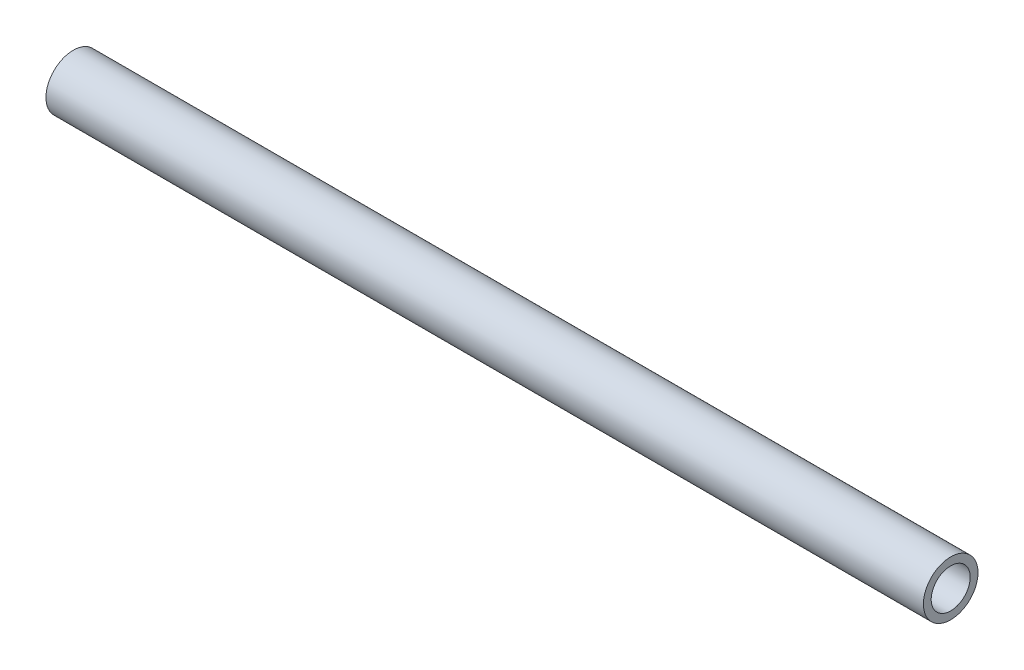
ISO-10303-21;
HEADER;
FILE_DESCRIPTION(('STEP AP214'),'2;1');
FILE_NAME('part.step','',(''),(''),'','','');
FILE_SCHEMA(('AUTOMOTIVE_DESIGN { 1 0 10303 214 1 1 1 1 }'));
ENDSEC;
DATA;
#1=APPLICATION_CONTEXT('core data for automotive mechanical design processes');
#2=APPLICATION_PROTOCOL_DEFINITION('international standard','automotive_design',2000,#1);
#3=PRODUCT_CONTEXT('',#1,'mechanical');
#4=PRODUCT('Part','Part','',(#3));
#5=PRODUCT_RELATED_PRODUCT_CATEGORY('part','',(#4));
#6=PRODUCT_DEFINITION_FORMATION('','',#4);
#7=PRODUCT_DEFINITION_CONTEXT('part definition',#1,'design');
#8=PRODUCT_DEFINITION('design','',#6,#7);
#9=PRODUCT_DEFINITION_SHAPE('','',#8);
#10=(LENGTH_UNIT() NAMED_UNIT(*) SI_UNIT(.MILLI.,.METRE.));
#11=(NAMED_UNIT(*) PLANE_ANGLE_UNIT() SI_UNIT($,.RADIAN.));
#12=(NAMED_UNIT(*) SI_UNIT($,.STERADIAN.) SOLID_ANGLE_UNIT());
#13=UNCERTAINTY_MEASURE_WITH_UNIT(LENGTH_MEASURE(1.E-05),#10,'distance_accuracy_value','');
#14=(GEOMETRIC_REPRESENTATION_CONTEXT(3) GLOBAL_UNCERTAINTY_ASSIGNED_CONTEXT((#13)) GLOBAL_UNIT_ASSIGNED_CONTEXT((#10,
#11,#12)) REPRESENTATION_CONTEXT('',''));
#15=CARTESIAN_POINT('',(0.,0.,0.));
#16=DIRECTION('',(0.,0.,1.));
#17=DIRECTION('',(1.,0.,0.));
#18=AXIS2_PLACEMENT_3D('',#15,#16,#17);
#19=CARTESIAN_POINT('',(342.9,0.,0.));
#20=DIRECTION('',(-1.,0.,0.));
#21=DIRECTION('',(0.,0.,1.));
#22=AXIS2_PLACEMENT_3D('',#19,#20,#21);
#23=CYLINDRICAL_SURFACE('',#22,7.62);
#24=CARTESIAN_POINT('',(342.9,0.,0.));
#25=DIRECTION('',(1.,0.,0.));
#26=DIRECTION('',(0.,0.,-1.));
#27=AXIS2_PLACEMENT_3D('',#24,#25,#26);
#28=CIRCLE('',#27,7.62);
#29=CARTESIAN_POINT('',(342.9,0.,-7.62));
#30=VERTEX_POINT('',#29);
#31=EDGE_CURVE('E53',#30,#30,#28,.T.);
#32=ORIENTED_EDGE('',*,*,#31,.T.);
#33=EDGE_LOOP('',(#32));
#34=FACE_BOUND('',#33,.T.);
#35=CARTESIAN_POINT('',(0.,0.,0.));
#36=DIRECTION('',(1.,0.,0.));
#37=DIRECTION('',(0.,0.,-1.));
#38=AXIS2_PLACEMENT_3D('',#35,#36,#37);
#39=CIRCLE('',#38,7.62);
#40=CARTESIAN_POINT('',(0.,0.,-7.62));
#41=VERTEX_POINT('',#40);
#42=EDGE_CURVE('E60',#41,#41,#39,.T.);
#43=ORIENTED_EDGE('',*,*,#42,.F.);
#44=EDGE_LOOP('',(#43));
#45=FACE_BOUND('',#44,.T.);
#46=ADVANCED_FACE('F45',(#34,#45),#23,.F.);
#47=CARTESIAN_POINT('',(342.9,0.,0.));
#48=DIRECTION('',(-1.,0.,0.));
#49=DIRECTION('',(0.,0.,1.));
#50=AXIS2_PLACEMENT_3D('',#47,#48,#49);
#51=CYLINDRICAL_SURFACE('',#50,10.668);
#52=CARTESIAN_POINT('',(342.9,0.,0.));
#53=DIRECTION('',(1.,0.,0.));
#54=DIRECTION('',(0.,0.,-1.));
#55=AXIS2_PLACEMENT_3D('',#52,#53,#54);
#56=CIRCLE('',#55,10.668);
#57=CARTESIAN_POINT('',(342.9,0.,-10.668));
#58=VERTEX_POINT('',#57);
#59=EDGE_CURVE('E10',#58,#58,#56,.T.);
#60=ORIENTED_EDGE('',*,*,#59,.F.);
#61=EDGE_LOOP('',(#60));
#62=FACE_BOUND('',#61,.T.);
#63=CARTESIAN_POINT('',(0.,0.,0.));
#64=DIRECTION('',(1.,0.,0.));
#65=DIRECTION('',(0.,0.,-1.));
#66=AXIS2_PLACEMENT_3D('',#63,#64,#65);
#67=CIRCLE('',#66,10.668);
#68=CARTESIAN_POINT('',(0.,0.,-10.668));
#69=VERTEX_POINT('',#68);
#70=EDGE_CURVE('E48',#69,#69,#67,.T.);
#71=ORIENTED_EDGE('',*,*,#70,.T.);
#72=EDGE_LOOP('',(#71));
#73=FACE_BOUND('',#72,.T.);
#74=ADVANCED_FACE('F69',(#62,#73),#51,.T.);
#75=CARTESIAN_POINT('',(342.9,0.,0.));
#76=DIRECTION('',(1.,0.,0.));
#77=DIRECTION('',(0.,0.,-1.));
#78=AXIS2_PLACEMENT_3D('',#75,#76,#77);
#79=PLANE('',#78);
#80=ORIENTED_EDGE('',*,*,#31,.F.);
#81=EDGE_LOOP('',(#80));
#82=FACE_BOUND('',#81,.T.);
#83=ORIENTED_EDGE('',*,*,#59,.T.);
#84=EDGE_LOOP('',(#83));
#85=FACE_BOUND('',#84,.T.);
#86=ADVANCED_FACE('F73',(#82,#85),#79,.T.);
#87=CARTESIAN_POINT('',(0.,0.,0.));
#88=DIRECTION('',(1.,0.,0.));
#89=DIRECTION('',(0.,0.,-1.));
#90=AXIS2_PLACEMENT_3D('',#87,#88,#89);
#91=PLANE('',#90);
#92=ORIENTED_EDGE('',*,*,#42,.T.);
#93=EDGE_LOOP('',(#92));
#94=FACE_BOUND('',#93,.T.);
#95=ORIENTED_EDGE('',*,*,#70,.F.);
#96=EDGE_LOOP('',(#95));
#97=FACE_BOUND('',#96,.T.);
#98=ADVANCED_FACE('F71',(#94,#97),#91,.F.);
#99=CLOSED_SHELL('',(#46,#74,#86,#98));
#100=MANIFOLD_SOLID_BREP('B2',#99);
#101=ADVANCED_BREP_SHAPE_REPRESENTATION('',(#18,#100),#14);
#102=SHAPE_DEFINITION_REPRESENTATION(#9,#101);
ENDSEC;
END-ISO-10303-21;
